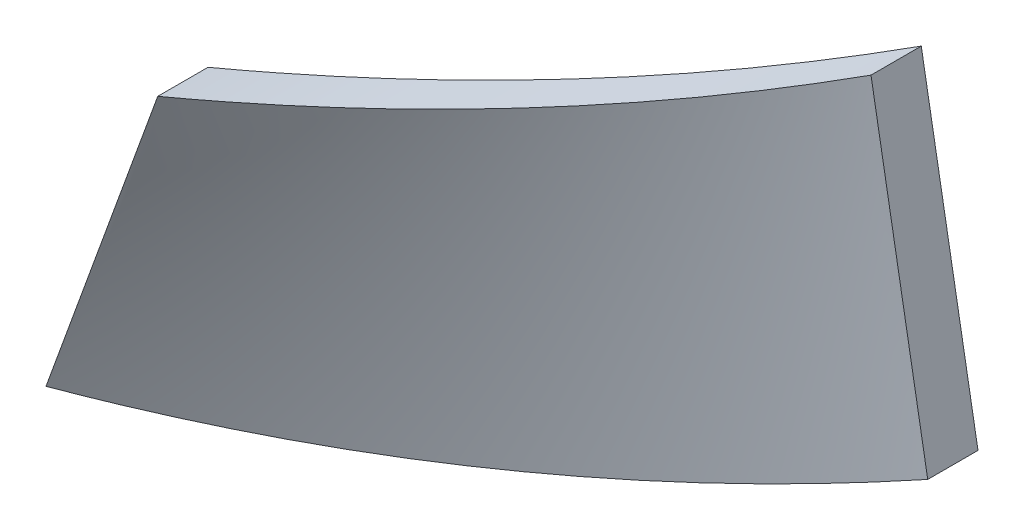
ISO-10303-21;
HEADER;
FILE_DESCRIPTION(('STEP AP214'),'2;1');
FILE_NAME('part.step','',(''),(''),'','','');
FILE_SCHEMA(('AUTOMOTIVE_DESIGN { 1 0 10303 214 1 1 1 1 }'));
ENDSEC;
DATA;
#1=APPLICATION_CONTEXT('core data for automotive mechanical design processes');
#2=APPLICATION_PROTOCOL_DEFINITION('international standard','automotive_design',2000,#1);
#3=PRODUCT_CONTEXT('',#1,'mechanical');
#4=PRODUCT('Part','Part','',(#3));
#5=PRODUCT_RELATED_PRODUCT_CATEGORY('part','',(#4));
#6=PRODUCT_DEFINITION_FORMATION('','',#4);
#7=PRODUCT_DEFINITION_CONTEXT('part definition',#1,'design');
#8=PRODUCT_DEFINITION('design','',#6,#7);
#9=PRODUCT_DEFINITION_SHAPE('','',#8);
#10=(LENGTH_UNIT() NAMED_UNIT(*) SI_UNIT(.MILLI.,.METRE.));
#11=(NAMED_UNIT(*) PLANE_ANGLE_UNIT() SI_UNIT($,.RADIAN.));
#12=(NAMED_UNIT(*) SI_UNIT($,.STERADIAN.) SOLID_ANGLE_UNIT());
#13=UNCERTAINTY_MEASURE_WITH_UNIT(LENGTH_MEASURE(1.E-05),#10,'distance_accuracy_value','');
#14=(GEOMETRIC_REPRESENTATION_CONTEXT(3) GLOBAL_UNCERTAINTY_ASSIGNED_CONTEXT((#13)) GLOBAL_UNIT_ASSIGNED_CONTEXT((#10,
#11,#12)) REPRESENTATION_CONTEXT('',''));
#15=CARTESIAN_POINT('',(0.,0.,0.));
#16=DIRECTION('',(0.,0.,1.));
#17=DIRECTION('',(1.,0.,0.));
#18=AXIS2_PLACEMENT_3D('',#15,#16,#17);
#19=CARTESIAN_POINT('',(2.08377813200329,-11.8176930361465,2.));
#20=CARTESIAN_POINT('',(0.98870760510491,-12.0107835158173,3.41176470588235));
#21=CARTESIAN_POINT('',(-0.123197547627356,-11.9993675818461,4.82352941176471));
#22=CARTESIAN_POINT('',(-1.23510270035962,-11.9879516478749,6.23529411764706));
#23=CARTESIAN_POINT('',(-2.32597788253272,-11.7724180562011,7.64705882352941));
#24=CARTESIAN_POINT('',(-3.23406919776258,-11.5929986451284,8.82227234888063));
#25=CARTESIAN_POINT('',(-4.10390178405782,-11.2764351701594,10.0002842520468));
#26=CARTESIAN_POINT('',(-4.13341338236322,-11.2656948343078,10.0402517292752));
#27=CARTESIAN_POINT('',(-4.16292498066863,-11.2549544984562,10.0802192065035));
#28=CARTESIAN_POINT('',(3.2124912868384,-18.2189434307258,2.));
#29=CARTESIAN_POINT('',(1.52425755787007,-18.516624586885,3.41176470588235));
#30=CARTESIAN_POINT('',(-0.189929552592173,-18.4990250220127,4.82352941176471));
#31=CARTESIAN_POINT('',(-1.90411666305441,-18.4814254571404,6.23529411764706));
#32=CARTESIAN_POINT('',(-3.58588256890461,-18.14914450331,7.64705882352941));
#33=CARTESIAN_POINT('',(-4.98585667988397,-17.8725395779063,8.82227234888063));
#34=CARTESIAN_POINT('',(-6.32684858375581,-17.3845042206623,10.0002842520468));
#35=CARTESIAN_POINT('',(-6.3723456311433,-17.3679462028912,10.0402517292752));
#36=CARTESIAN_POINT('',(-6.4178426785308,-17.35138818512,10.0802192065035));
#37=(BOUNDED_SURFACE() B_SPLINE_SURFACE(1,2,((#19,#20,#21,#22,#23,#24,#25,#26,#27),(#28,#29,#30,
#31,#32,#33,#34,#35,#36)),.UNSPECIFIED.,.F.,.F.,.F.) B_SPLINE_SURFACE_WITH_KNOTS((2,2),(3,2,2,2,
3),(0.,1.),(0.,0.0294117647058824,0.0588235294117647,0.0833246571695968,0.0841579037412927),
.UNSPECIFIED.) GEOMETRIC_REPRESENTATION_ITEM() RATIONAL_B_SPLINE_SURFACE(((1.,0.995734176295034,
1.,0.995734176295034,1.,0.996446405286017,0.99881337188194,0.99881337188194,0.99881337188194),
(1.,0.995734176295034,1.,0.995734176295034,1.,0.996446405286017,0.99881337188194,
0.99881337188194,0.99881337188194))) REPRESENTATION_ITEM('') SURFACE());
#38=CARTESIAN_POINT('',(2.08377813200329,-11.8176930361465,2.));
#39=CARTESIAN_POINT('',(0.98870760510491,-12.0107835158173,3.41176470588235));
#40=CARTESIAN_POINT('',(-0.123197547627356,-11.9993675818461,4.82352941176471));
#41=CARTESIAN_POINT('',(-1.23510270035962,-11.9879516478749,6.23529411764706));
#42=CARTESIAN_POINT('',(-2.32597788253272,-11.7724180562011,7.64705882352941));
#43=CARTESIAN_POINT('',(-3.23406919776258,-11.5929986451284,8.82227234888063));
#44=CARTESIAN_POINT('',(-4.10390178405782,-11.2764351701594,10.0002842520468));
#45=CARTESIAN_POINT('',(-4.13341338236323,-11.2656948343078,10.0402517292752));
#46=CARTESIAN_POINT('',(-4.16292498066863,-11.2549544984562,10.0802192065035));
#47=(BOUNDED_CURVE() B_SPLINE_CURVE(2,(#38,#39,#40,#41,#42,#43,#44,#45,#46),.UNSPECIFIED.,.F.,
.F.) B_SPLINE_CURVE_WITH_KNOTS((3,2,2,2,3),(0.,0.0294117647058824,0.0588235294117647,
0.0833246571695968,0.0841579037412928),
.UNSPECIFIED.) CURVE() GEOMETRIC_REPRESENTATION_ITEM() RATIONAL_B_SPLINE_CURVE((1.,
0.995734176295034,1.,0.995734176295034,1.,0.996446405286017,0.99881337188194,0.99881337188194,0.99881337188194)) REPRESENTATION_ITEM(''));
#48=CARTESIAN_POINT('',(2.08377813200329,-11.8176930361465,2.));
#49=VERTEX_POINT('',#48);
#50=CARTESIAN_POINT('',(-4.10396033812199,-11.2764138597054,10.0002842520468));
#51=VERTEX_POINT('',#50);
#52=EDGE_CURVE('E131',#49,#51,#47,.T.);
#53=CARTESIAN_POINT('',(-4.10401889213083,-11.2763925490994,10.0004428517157));
#54=CARTESIAN_POINT('',(-4.29006337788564,-11.787577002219,10.0004428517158));
#55=CARTESIAN_POINT('',(-4.47610786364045,-12.2987614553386,10.0004428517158));
#56=CARTESIAN_POINT('',(-4.84819683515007,-13.3211303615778,10.0004428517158));
#57=CARTESIAN_POINT('',(-5.03424132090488,-13.8323148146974,10.0004428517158));
#58=CARTESIAN_POINT('',(-5.58920024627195,-15.3571456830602,10.0004428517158));
#59=CARTESIAN_POINT('',(-5.95811468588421,-16.3707920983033,10.0004428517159));
#60=CARTESIAN_POINT('',(-6.32702912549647,-17.3844385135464,10.0004428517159));
#61=B_SPLINE_CURVE_WITH_KNOTS('',3,(#53,#54,#55,#56,#57,#58,#59,#60),.UNSPECIFIED.,.F.,.F.,(4,2,
2,4),(0.,1.63196166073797,3.26392332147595,6.50000000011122),.UNSPECIFIED.);
#62=CARTESIAN_POINT('',(-6.32698399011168,-17.384454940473,10.0003635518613));
#63=VERTEX_POINT('',#62);
#64=EDGE_CURVE('E61',#51,#63,#61,.T.);
#65=CARTESIAN_POINT('',(3.2124912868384,-18.2189434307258,2.));
#66=CARTESIAN_POINT('',(1.52425755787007,-18.516624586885,3.41176470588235));
#67=CARTESIAN_POINT('',(-0.189929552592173,-18.4990250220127,4.82352941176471));
#68=CARTESIAN_POINT('',(-1.90411666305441,-18.4814254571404,6.23529411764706));
#69=CARTESIAN_POINT('',(-3.58588256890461,-18.14914450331,7.64705882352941));
#70=CARTESIAN_POINT('',(-4.98585667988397,-17.8725395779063,8.82227234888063));
#71=CARTESIAN_POINT('',(-6.32684858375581,-17.3845042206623,10.0002842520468));
#72=CARTESIAN_POINT('',(-6.3723456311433,-17.3679462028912,10.0402517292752));
#73=CARTESIAN_POINT('',(-6.4178426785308,-17.35138818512,10.0802192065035));
#74=(BOUNDED_CURVE() B_SPLINE_CURVE(2,(#65,#66,#67,#68,#69,#70,#71,#72,#73),.UNSPECIFIED.,.F.,
.F.) B_SPLINE_CURVE_WITH_KNOTS((3,2,2,2,3),(0.,0.0294117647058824,0.0588235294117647,
0.0833246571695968,0.0841579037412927),
.UNSPECIFIED.) CURVE() GEOMETRIC_REPRESENTATION_ITEM() RATIONAL_B_SPLINE_CURVE((1.,
0.995734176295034,1.,0.995734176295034,1.,0.996446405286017,0.99881337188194,0.99881337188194,0.99881337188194)) REPRESENTATION_ITEM(''));
#75=CARTESIAN_POINT('',(3.2124912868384,-18.2189434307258,2.));
#76=VERTEX_POINT('',#75);
#77=EDGE_CURVE('E58',#63,#76,#74,.F.);
#78=DIRECTION('',(-0.17364817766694,0.984807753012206,0.));
#79=VECTOR('',#78,1.);
#80=CARTESIAN_POINT('',(3.2124912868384,-18.2189434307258,2.));
#81=LINE('',#80,#79);
#82=EDGE_CURVE('E59',#49,#76,#81,.F.);
#83=ORIENTED_EDGE('',*,*,#52,.T.);
#84=ORIENTED_EDGE('',*,*,#64,.T.);
#85=ORIENTED_EDGE('',*,*,#77,.T.);
#86=ORIENTED_EDGE('',*,*,#82,.F.);
#87=EDGE_LOOP('',(#83,#84,#85,#86));
#88=FACE_BOUND('',#87,.T.);
#89=ADVANCED_FACE('F17',(#88),#37,.F.);
#90=CARTESIAN_POINT('',(2.08377813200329,-11.8176930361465,1.));
#91=CARTESIAN_POINT('',(0.98870760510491,-12.0107835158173,2.41176470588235));
#92=CARTESIAN_POINT('',(-0.123197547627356,-11.9993675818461,3.82352941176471));
#93=CARTESIAN_POINT('',(-1.23510270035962,-11.9879516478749,5.23529411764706));
#94=CARTESIAN_POINT('',(-2.32597788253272,-11.7724180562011,6.64705882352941));
#95=CARTESIAN_POINT('',(-3.23406919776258,-11.5929986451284,7.82227234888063));
#96=CARTESIAN_POINT('',(-4.10390178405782,-11.2764351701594,9.00028425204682));
#97=CARTESIAN_POINT('',(-4.13341338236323,-11.2656948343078,9.04025172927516));
#98=CARTESIAN_POINT('',(-4.16292498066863,-11.2549544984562,9.08021920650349));
#99=CARTESIAN_POINT('',(2.08377813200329,-11.8176930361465,2.));
#100=CARTESIAN_POINT('',(0.98870760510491,-12.0107835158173,3.41176470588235));
#101=CARTESIAN_POINT('',(-0.123197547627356,-11.9993675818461,4.82352941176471));
#102=CARTESIAN_POINT('',(-1.23510270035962,-11.9879516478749,6.23529411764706));
#103=CARTESIAN_POINT('',(-2.32597788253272,-11.7724180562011,7.64705882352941));
#104=CARTESIAN_POINT('',(-3.23406919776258,-11.5929986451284,8.82227234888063));
#105=CARTESIAN_POINT('',(-4.10390178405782,-11.2764351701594,10.0002842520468));
#106=CARTESIAN_POINT('',(-4.13341338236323,-11.2656948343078,10.0402517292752));
#107=CARTESIAN_POINT('',(-4.16292498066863,-11.2549544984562,10.0802192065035));
#108=(BOUNDED_SURFACE() B_SPLINE_SURFACE(1,2,((#90,#91,#92,#93,#94,#95,#96,#97,#98),(#99,#100,
#101,#102,#103,#104,#105,#106,#107)),.UNSPECIFIED.,.F.,.F.,.F.) B_SPLINE_SURFACE_WITH_KNOTS((2,
2),(3,2,2,2,3),(0.,1.),(0.,0.0294117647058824,0.0588235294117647,0.0833246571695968,
0.0841579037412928),
.UNSPECIFIED.) GEOMETRIC_REPRESENTATION_ITEM() RATIONAL_B_SPLINE_SURFACE(((1.,0.995734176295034,
1.,0.995734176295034,1.,0.996446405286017,0.99881337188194,0.99881337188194,0.99881337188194),
(1.,0.995734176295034,1.,0.995734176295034,1.,0.996446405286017,0.99881337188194,
0.99881337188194,0.99881337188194))) REPRESENTATION_ITEM('') SURFACE());
#109=CARTESIAN_POINT('',(2.08377813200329,-11.8176930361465,1.));
#110=CARTESIAN_POINT('',(0.98870760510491,-12.0107835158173,2.41176470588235));
#111=CARTESIAN_POINT('',(-0.123197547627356,-11.9993675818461,3.82352941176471));
#112=CARTESIAN_POINT('',(-1.23510270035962,-11.9879516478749,5.23529411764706));
#113=CARTESIAN_POINT('',(-2.32597788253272,-11.7724180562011,6.64705882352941));
#114=CARTESIAN_POINT('',(-3.23406919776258,-11.5929986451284,7.82227234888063));
#115=CARTESIAN_POINT('',(-4.10390178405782,-11.2764351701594,9.00028425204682));
#116=CARTESIAN_POINT('',(-4.13341338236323,-11.2656948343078,9.04025172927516));
#117=CARTESIAN_POINT('',(-4.16292498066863,-11.2549544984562,9.08021920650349));
#118=(BOUNDED_CURVE() B_SPLINE_CURVE(2,(#109,#110,#111,#112,#113,#114,#115,#116,#117),
.UNSPECIFIED.,.F.,.F.) B_SPLINE_CURVE_WITH_KNOTS((3,2,2,2,3),(0.,0.0294117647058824,
0.0588235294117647,0.0833246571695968,0.0841579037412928),
.UNSPECIFIED.) CURVE() GEOMETRIC_REPRESENTATION_ITEM() RATIONAL_B_SPLINE_CURVE((1.,
0.995734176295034,1.,0.995734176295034,1.,0.996446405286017,0.99881337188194,0.99881337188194,0.99881337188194)) REPRESENTATION_ITEM(''));
#119=CARTESIAN_POINT('',(2.08377813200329,-11.8176930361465,1.));
#120=VERTEX_POINT('',#119);
#121=CARTESIAN_POINT('',(-4.10401889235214,-11.2763925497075,9.00044285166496));
#122=VERTEX_POINT('',#121);
#123=EDGE_CURVE('E70',#120,#122,#118,.T.);
#124=DIRECTION('',(0.,0.,1.));
#125=VECTOR('',#124,1.);
#126=CARTESIAN_POINT('',(-4.10401889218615,-11.2763925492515,9.2504428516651));
#127=LINE('',#126,#125);
#128=EDGE_CURVE('E127',#122,#51,#127,.T.);
#129=DIRECTION('',(0.,0.,1.));
#130=VECTOR('',#129,1.);
#131=CARTESIAN_POINT('',(2.08377813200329,-11.8176930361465,1.5));
#132=LINE('',#131,#130);
#133=EDGE_CURVE('E69',#120,#49,#132,.T.);
#134=ORIENTED_EDGE('',*,*,#123,.T.);
#135=ORIENTED_EDGE('',*,*,#128,.T.);
#136=ORIENTED_EDGE('',*,*,#52,.F.);
#137=ORIENTED_EDGE('',*,*,#133,.F.);
#138=EDGE_LOOP('',(#134,#135,#136,#137));
#139=FACE_BOUND('',#138,.T.);
#140=ADVANCED_FACE('F119',(#139),#108,.F.);
#141=CARTESIAN_POINT('',(-6.32702912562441,-17.384438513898,9.2504428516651));
#142=DIRECTION('',(0.939699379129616,-0.342001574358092,0.));
#143=DIRECTION('',(0.342001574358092,0.939699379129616,0.));
#144=AXIS2_PLACEMENT_3D('',#141,#142,#143);
#145=PLANE('',#144);
#146=ORIENTED_EDGE('',*,*,#64,.F.);
#147=ORIENTED_EDGE('',*,*,#128,.F.);
#148=CARTESIAN_POINT('',(-4.10401889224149,-11.2763925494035,9.00044285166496));
#149=CARTESIAN_POINT('',(-4.29006337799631,-11.7875770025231,9.00044285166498));
#150=CARTESIAN_POINT('',(-4.47610786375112,-12.2987614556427,9.000442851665));
#151=CARTESIAN_POINT('',(-4.84819683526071,-13.3211303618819,9.00044285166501));
#152=CARTESIAN_POINT('',(-5.0342413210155,-13.8323148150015,9.00044285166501));
#153=CARTESIAN_POINT('',(-5.58920024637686,-15.3571456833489,9.000442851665));
#154=CARTESIAN_POINT('',(-5.95811468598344,-16.3707920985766,9.00044285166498));
#155=CARTESIAN_POINT('',(-6.32702912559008,-17.3844385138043,9.000442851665));
#156=B_SPLINE_CURVE_WITH_KNOTS('',3,(#148,#149,#150,#151,#152,#153,#154,#155),.UNSPECIFIED.,.F.,
.F.,(4,2,2,4),(0.,1.63196166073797,3.26392332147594,6.50000000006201),.UNSPECIFIED.);
#157=CARTESIAN_POINT('',(-6.32702912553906,-17.3844385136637,9.0004428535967));
#158=VERTEX_POINT('',#157);
#159=EDGE_CURVE('E80',#122,#158,#156,.T.);
#160=ORIENTED_EDGE('',*,*,#159,.T.);
#161=DIRECTION('',(0.,0.,1.));
#162=VECTOR('',#161,1.);
#163=CARTESIAN_POINT('',(-6.32702912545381,-17.3844385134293,9.2504428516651));
#164=LINE('',#163,#162);
#165=EDGE_CURVE('E64',#158,#63,#164,.T.);
#166=ORIENTED_EDGE('',*,*,#165,.T.);
#167=EDGE_LOOP('',(#146,#147,#160,#166));
#168=FACE_BOUND('',#167,.T.);
#169=ADVANCED_FACE('F91',(#168),#145,.F.);
#170=CARTESIAN_POINT('',(3.2124912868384,-18.2189434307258,2.));
#171=CARTESIAN_POINT('',(1.52425755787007,-18.516624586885,3.41176470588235));
#172=CARTESIAN_POINT('',(-0.189929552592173,-18.4990250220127,4.82352941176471));
#173=CARTESIAN_POINT('',(-1.90411666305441,-18.4814254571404,6.23529411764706));
#174=CARTESIAN_POINT('',(-3.58588256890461,-18.14914450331,7.64705882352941));
#175=CARTESIAN_POINT('',(-4.98595148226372,-17.8725208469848,8.82235193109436));
#176=CARTESIAN_POINT('',(-6.32702912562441,-17.384438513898,10.0004428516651));
#177=CARTESIAN_POINT('',(3.2124912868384,-18.2189434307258,1.));
#178=CARTESIAN_POINT('',(1.52425755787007,-18.516624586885,2.41176470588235));
#179=CARTESIAN_POINT('',(-0.189929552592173,-18.4990250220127,3.82352941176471));
#180=CARTESIAN_POINT('',(-1.90411666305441,-18.4814254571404,5.23529411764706));
#181=CARTESIAN_POINT('',(-3.58588256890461,-18.14914450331,6.64705882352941));
#182=CARTESIAN_POINT('',(-4.98595148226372,-17.8725208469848,7.82235193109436));
#183=CARTESIAN_POINT('',(-6.32702912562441,-17.384438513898,9.0004428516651));
#184=(BOUNDED_SURFACE() B_SPLINE_SURFACE(1,2,((#170,#171,#172,#173,#174,#175,#176),(#177,#178,
#179,#180,#181,#182,#183)),.UNSPECIFIED.,.F.,.F.,.F.) B_SPLINE_SURFACE_WITH_KNOTS((2,2),(3,2,2,
3),(0.,1.),(0.,0.0294117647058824,0.0588235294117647,0.083326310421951),
.UNSPECIFIED.) GEOMETRIC_REPRESENTATION_ITEM() RATIONAL_B_SPLINE_SURFACE(((1.,0.995734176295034,
1.,0.995734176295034,1.,0.996446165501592,0.998813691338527),(1.,0.995734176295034,1.,
0.995734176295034,1.,0.996446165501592,0.998813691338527))) REPRESENTATION_ITEM('') SURFACE());
#185=CARTESIAN_POINT('',(3.2124912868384,-18.2189434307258,1.));
#186=CARTESIAN_POINT('',(1.52425755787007,-18.516624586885,2.41176470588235));
#187=CARTESIAN_POINT('',(-0.189929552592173,-18.4990250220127,3.82352941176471));
#188=CARTESIAN_POINT('',(-1.90411666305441,-18.4814254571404,5.23529411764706));
#189=CARTESIAN_POINT('',(-3.58588256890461,-18.14914450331,6.64705882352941));
#190=CARTESIAN_POINT('',(-4.98595148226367,-17.8725208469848,7.82235193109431));
#191=CARTESIAN_POINT('',(-6.3270291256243,-17.384438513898,9.000442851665));
#192=(BOUNDED_CURVE() B_SPLINE_CURVE(2,(#185,#186,#187,#188,#189,#190,#191),.UNSPECIFIED.,.F.,
.F.) B_SPLINE_CURVE_WITH_KNOTS((3,2,2,3),(0.,0.0294117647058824,0.0588235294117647,
0.0833263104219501),
.UNSPECIFIED.) CURVE() GEOMETRIC_REPRESENTATION_ITEM() RATIONAL_B_SPLINE_CURVE((1.,
0.995734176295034,1.,0.995734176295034,1.,0.996446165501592,0.998813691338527)) REPRESENTATION_ITEM(''));
#193=CARTESIAN_POINT('',(3.2124912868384,-18.2189434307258,1.));
#194=VERTEX_POINT('',#193);
#195=EDGE_CURVE('E29',#158,#194,#192,.F.);
#196=DIRECTION('',(0.,0.,1.));
#197=VECTOR('',#196,1.);
#198=CARTESIAN_POINT('',(3.2124912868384,-18.2189434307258,1.5));
#199=LINE('',#198,#197);
#200=EDGE_CURVE('E37',#76,#194,#199,.F.);
#201=ORIENTED_EDGE('',*,*,#77,.F.);
#202=ORIENTED_EDGE('',*,*,#165,.F.);
#203=ORIENTED_EDGE('',*,*,#195,.T.);
#204=ORIENTED_EDGE('',*,*,#200,.F.);
#205=EDGE_LOOP('',(#201,#202,#203,#204));
#206=FACE_BOUND('',#205,.T.);
#207=ADVANCED_FACE('F73',(#206),#184,.F.);
#208=CARTESIAN_POINT('',(3.2124912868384,-18.2189434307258,1.5));
#209=DIRECTION('',(0.984807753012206,0.17364817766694,0.));
#210=DIRECTION('',(-0.17364817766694,0.984807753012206,0.));
#211=AXIS2_PLACEMENT_3D('',#208,#209,#210);
#212=PLANE('',#211);
#213=ORIENTED_EDGE('',*,*,#133,.T.);
#214=ORIENTED_EDGE('',*,*,#82,.T.);
#215=ORIENTED_EDGE('',*,*,#200,.T.);
#216=DIRECTION('',(-0.17364817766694,0.984807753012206,0.));
#217=VECTOR('',#216,1.);
#218=CARTESIAN_POINT('',(2.64813470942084,-15.0183182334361,1.));
#219=LINE('',#218,#217);
#220=EDGE_CURVE('E11',#194,#120,#219,.T.);
#221=ORIENTED_EDGE('',*,*,#220,.T.);
#222=EDGE_LOOP('',(#213,#214,#215,#221));
#223=FACE_BOUND('',#222,.T.);
#224=ADVANCED_FACE('F67',(#223),#212,.T.);
#225=CARTESIAN_POINT('',(3.2124912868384,-18.2189434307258,1.));
#226=CARTESIAN_POINT('',(1.52425755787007,-18.516624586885,2.41176470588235));
#227=CARTESIAN_POINT('',(-0.189929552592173,-18.4990250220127,3.82352941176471));
#228=CARTESIAN_POINT('',(-1.90411666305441,-18.4814254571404,5.23529411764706));
#229=CARTESIAN_POINT('',(-3.58588256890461,-18.14914450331,6.64705882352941));
#230=CARTESIAN_POINT('',(-4.98595148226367,-17.8725208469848,7.82235193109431));
#231=CARTESIAN_POINT('',(-6.3270291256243,-17.384438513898,9.000442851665));
#232=CARTESIAN_POINT('',(2.08377813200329,-11.8176930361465,1.));
#233=CARTESIAN_POINT('',(0.98870760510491,-12.0107835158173,2.41176470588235));
#234=CARTESIAN_POINT('',(-0.123197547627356,-11.9993675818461,3.82352941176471));
#235=CARTESIAN_POINT('',(-1.23510270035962,-11.9879516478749,5.23529411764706));
#236=CARTESIAN_POINT('',(-2.32597788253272,-11.7724180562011,6.64705882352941));
#237=CARTESIAN_POINT('',(-3.23413069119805,-11.5929864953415,7.82235193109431));
#238=CARTESIAN_POINT('',(-4.10401889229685,-11.2763925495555,9.000442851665));
#239=(BOUNDED_SURFACE() B_SPLINE_SURFACE(1,2,((#225,#226,#227,#228,#229,#230,#231),(#232,#233,
#234,#235,#236,#237,#238)),.UNSPECIFIED.,.F.,.F.,.F.) B_SPLINE_SURFACE_WITH_KNOTS((2,2),(3,2,2,
3),(0.,1.),(0.,0.0294117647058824,0.0588235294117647,0.0833263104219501),
.UNSPECIFIED.) GEOMETRIC_REPRESENTATION_ITEM() RATIONAL_B_SPLINE_SURFACE(((1.,0.995734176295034,
1.,0.995734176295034,1.,0.996446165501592,0.998813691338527),(1.,0.995734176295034,1.,
0.995734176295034,1.,0.996446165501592,0.998813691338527))) REPRESENTATION_ITEM('') SURFACE());
#240=ORIENTED_EDGE('',*,*,#195,.F.);
#241=ORIENTED_EDGE('',*,*,#159,.F.);
#242=ORIENTED_EDGE('',*,*,#123,.F.);
#243=ORIENTED_EDGE('',*,*,#220,.F.);
#244=EDGE_LOOP('',(#240,#241,#242,#243));
#245=FACE_BOUND('',#244,.T.);
#246=ADVANCED_FACE('F94',(#245),#239,.F.);
#247=CLOSED_SHELL('',(#89,#140,#169,#207,#224,#246));
#248=MANIFOLD_SOLID_BREP('B1',#247);
#249=ADVANCED_BREP_SHAPE_REPRESENTATION('',(#18,#248),#14);
#250=SHAPE_DEFINITION_REPRESENTATION(#9,#249);
ENDSEC;
END-ISO-10303-21;
